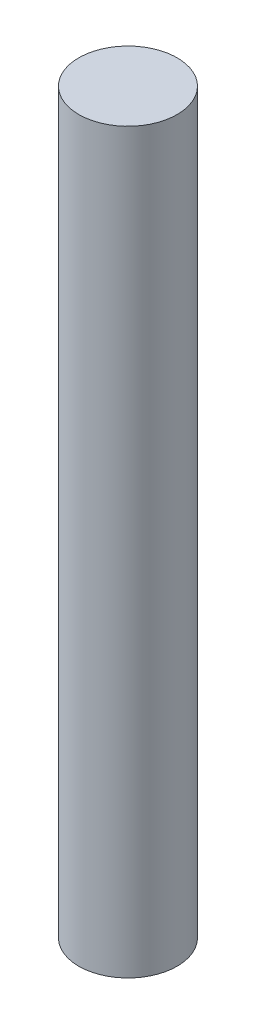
from build123d import *

# Parameters (mm, degrees)
SKETCH1_R      = 2
EXTRUDE1_DEPTH = 30


with BuildPart() as part:
    # Sketch1 → Extrude1 (new body)
    with BuildSketch(Plane(origin=(0, 0, 0), x_dir=(1, 0, 0), z_dir=(0, 1, 0))):
        with Locations(Location((0, 0, 0), (0, 0, 270))):
            Circle(SKETCH1_R)
    extrude(amount=EXTRUDE1_DEPTH)


solid = part.part
